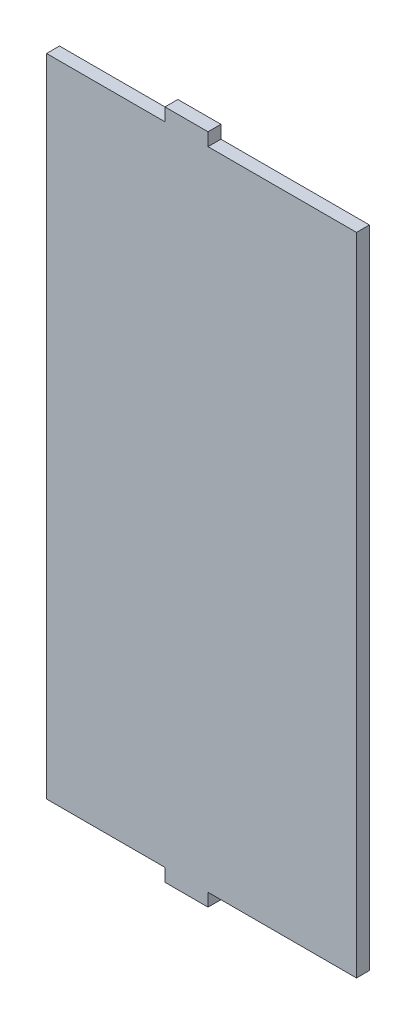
ISO-10303-21;
HEADER;
FILE_DESCRIPTION(('STEP AP214'),'2;1');
FILE_NAME('part.step','',(''),(''),'','','');
FILE_SCHEMA(('AUTOMOTIVE_DESIGN { 1 0 10303 214 1 1 1 1 }'));
ENDSEC;
DATA;
#1=APPLICATION_CONTEXT('core data for automotive mechanical design processes');
#2=APPLICATION_PROTOCOL_DEFINITION('international standard','automotive_design',2000,#1);
#3=PRODUCT_CONTEXT('',#1,'mechanical');
#4=PRODUCT('Part','Part','',(#3));
#5=PRODUCT_RELATED_PRODUCT_CATEGORY('part','',(#4));
#6=PRODUCT_DEFINITION_FORMATION('','',#4);
#7=PRODUCT_DEFINITION_CONTEXT('part definition',#1,'design');
#8=PRODUCT_DEFINITION('design','',#6,#7);
#9=PRODUCT_DEFINITION_SHAPE('','',#8);
#10=(LENGTH_UNIT() NAMED_UNIT(*) SI_UNIT(.MILLI.,.METRE.));
#11=(NAMED_UNIT(*) PLANE_ANGLE_UNIT() SI_UNIT($,.RADIAN.));
#12=(NAMED_UNIT(*) SI_UNIT($,.STERADIAN.) SOLID_ANGLE_UNIT());
#13=UNCERTAINTY_MEASURE_WITH_UNIT(LENGTH_MEASURE(1.E-05),#10,'distance_accuracy_value','');
#14=(GEOMETRIC_REPRESENTATION_CONTEXT(3) GLOBAL_UNCERTAINTY_ASSIGNED_CONTEXT((#13)) GLOBAL_UNIT_ASSIGNED_CONTEXT((#10,
#11,#12)) REPRESENTATION_CONTEXT('',''));
#15=CARTESIAN_POINT('',(0.,0.,0.));
#16=DIRECTION('',(0.,0.,1.));
#17=DIRECTION('',(1.,0.,0.));
#18=AXIS2_PLACEMENT_3D('',#15,#16,#17);
#19=CARTESIAN_POINT('',(-150.,375.,15.));
#20=DIRECTION('',(1.,0.,0.));
#21=DIRECTION('',(0.,1.,0.));
#22=AXIS2_PLACEMENT_3D('',#19,#20,#21);
#23=PLANE('',#22);
#24=DIRECTION('',(0.,-1.,0.));
#25=VECTOR('',#24,1.);
#26=CARTESIAN_POINT('',(-150.,375.,0.));
#27=LINE('',#26,#25);
#28=CARTESIAN_POINT('',(-150.,375.,0.));
#29=VERTEX_POINT('',#28);
#30=CARTESIAN_POINT('',(-150.,-375.,0.));
#31=VERTEX_POINT('',#30);
#32=EDGE_CURVE('E157',#29,#31,#27,.T.);
#33=ORIENTED_EDGE('',*,*,#32,.T.);
#34=DIRECTION('',(0.,0.,-1.));
#35=VECTOR('',#34,1.);
#36=CARTESIAN_POINT('',(-150.,-375.,15.));
#37=LINE('',#36,#35);
#38=CARTESIAN_POINT('',(-150.,-375.,15.));
#39=VERTEX_POINT('',#38);
#40=EDGE_CURVE('E11',#39,#31,#37,.T.);
#41=ORIENTED_EDGE('',*,*,#40,.F.);
#42=DIRECTION('',(0.,-1.,0.));
#43=VECTOR('',#42,1.);
#44=CARTESIAN_POINT('',(-150.,375.,15.));
#45=LINE('',#44,#43);
#46=CARTESIAN_POINT('',(-150.,375.,15.));
#47=VERTEX_POINT('',#46);
#48=EDGE_CURVE('E179',#47,#39,#45,.T.);
#49=ORIENTED_EDGE('',*,*,#48,.F.);
#50=DIRECTION('',(0.,0.,-1.));
#51=VECTOR('',#50,1.);
#52=CARTESIAN_POINT('',(-150.,375.,15.));
#53=LINE('',#52,#51);
#54=EDGE_CURVE('E153',#47,#29,#53,.T.);
#55=ORIENTED_EDGE('',*,*,#54,.T.);
#56=EDGE_LOOP('',(#33,#41,#49,#55));
#57=FACE_BOUND('',#56,.T.);
#58=ADVANCED_FACE('F37',(#57),#23,.F.);
#59=CARTESIAN_POINT('',(-150.,-375.,15.));
#60=DIRECTION('',(0.,1.,0.));
#61=DIRECTION('',(0.,0.,1.));
#62=AXIS2_PLACEMENT_3D('',#59,#60,#61);
#63=PLANE('',#62);
#64=DIRECTION('',(1.,0.,0.));
#65=VECTOR('',#64,1.);
#66=CARTESIAN_POINT('',(-150.,-375.,0.));
#67=LINE('',#66,#65);
#68=CARTESIAN_POINT('',(-12.4999999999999,-375.,0.));
#69=VERTEX_POINT('',#68);
#70=EDGE_CURVE('E160',#31,#69,#67,.T.);
#71=ORIENTED_EDGE('',*,*,#70,.T.);
#72=DIRECTION('',(0.,0.,-1.));
#73=VECTOR('',#72,1.);
#74=CARTESIAN_POINT('',(-12.4999999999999,-375.,15.));
#75=LINE('',#74,#73);
#76=CARTESIAN_POINT('',(-12.4999999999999,-375.,15.));
#77=VERTEX_POINT('',#76);
#78=EDGE_CURVE('E45',#77,#69,#75,.T.);
#79=ORIENTED_EDGE('',*,*,#78,.F.);
#80=DIRECTION('',(1.,0.,0.));
#81=VECTOR('',#80,1.);
#82=CARTESIAN_POINT('',(-150.,-375.,15.));
#83=LINE('',#82,#81);
#84=EDGE_CURVE('E108',#39,#77,#83,.T.);
#85=ORIENTED_EDGE('',*,*,#84,.F.);
#86=ORIENTED_EDGE('',*,*,#40,.T.);
#87=EDGE_LOOP('',(#71,#79,#85,#86));
#88=FACE_BOUND('',#87,.T.);
#89=ADVANCED_FACE('F257',(#88),#63,.F.);
#90=CARTESIAN_POINT('',(-12.4999999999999,-375.,15.));
#91=DIRECTION('',(1.,0.,0.));
#92=DIRECTION('',(0.,1.,0.));
#93=AXIS2_PLACEMENT_3D('',#90,#91,#92);
#94=PLANE('',#93);
#95=DIRECTION('',(0.,-1.,0.));
#96=VECTOR('',#95,1.);
#97=CARTESIAN_POINT('',(-12.4999999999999,-375.,0.));
#98=LINE('',#97,#96);
#99=CARTESIAN_POINT('',(-12.4999999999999,-390.,0.));
#100=VERTEX_POINT('',#99);
#101=EDGE_CURVE('E162',#69,#100,#98,.T.);
#102=ORIENTED_EDGE('',*,*,#101,.T.);
#103=DIRECTION('',(0.,0.,-1.));
#104=VECTOR('',#103,1.);
#105=CARTESIAN_POINT('',(-12.4999999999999,-390.,15.));
#106=LINE('',#105,#104);
#107=CARTESIAN_POINT('',(-12.4999999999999,-390.,15.));
#108=VERTEX_POINT('',#107);
#109=EDGE_CURVE('E198',#108,#100,#106,.T.);
#110=ORIENTED_EDGE('',*,*,#109,.F.);
#111=DIRECTION('',(0.,-1.,0.));
#112=VECTOR('',#111,1.);
#113=CARTESIAN_POINT('',(-12.4999999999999,-375.,15.));
#114=LINE('',#113,#112);
#115=EDGE_CURVE('E206',#77,#108,#114,.T.);
#116=ORIENTED_EDGE('',*,*,#115,.F.);
#117=ORIENTED_EDGE('',*,*,#78,.T.);
#118=EDGE_LOOP('',(#102,#110,#116,#117));
#119=FACE_BOUND('',#118,.T.);
#120=ADVANCED_FACE('F204',(#119),#94,.F.);
#121=CARTESIAN_POINT('',(-12.4999999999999,-390.,15.));
#122=DIRECTION('',(0.,1.,0.));
#123=DIRECTION('',(0.,0.,1.));
#124=AXIS2_PLACEMENT_3D('',#121,#122,#123);
#125=PLANE('',#124);
#126=DIRECTION('',(1.,0.,0.));
#127=VECTOR('',#126,1.);
#128=CARTESIAN_POINT('',(-12.4999999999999,-390.,0.));
#129=LINE('',#128,#127);
#130=CARTESIAN_POINT('',(37.5000000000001,-390.,0.));
#131=VERTEX_POINT('',#130);
#132=EDGE_CURVE('E164',#100,#131,#129,.T.);
#133=ORIENTED_EDGE('',*,*,#132,.T.);
#134=DIRECTION('',(0.,0.,-1.));
#135=VECTOR('',#134,1.);
#136=CARTESIAN_POINT('',(37.5000000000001,-390.,15.));
#137=LINE('',#136,#135);
#138=CARTESIAN_POINT('',(37.5000000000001,-390.,15.));
#139=VERTEX_POINT('',#138);
#140=EDGE_CURVE('E195',#139,#131,#137,.T.);
#141=ORIENTED_EDGE('',*,*,#140,.F.);
#142=DIRECTION('',(1.,0.,0.));
#143=VECTOR('',#142,1.);
#144=CARTESIAN_POINT('',(-12.4999999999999,-390.,15.));
#145=LINE('',#144,#143);
#146=EDGE_CURVE('E224',#108,#139,#145,.T.);
#147=ORIENTED_EDGE('',*,*,#146,.F.);
#148=ORIENTED_EDGE('',*,*,#109,.T.);
#149=EDGE_LOOP('',(#133,#141,#147,#148));
#150=FACE_BOUND('',#149,.T.);
#151=ADVANCED_FACE('F215',(#150),#125,.F.);
#152=CARTESIAN_POINT('',(37.5000000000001,-390.,15.));
#153=DIRECTION('',(-1.,0.,0.));
#154=DIRECTION('',(0.,0.,1.));
#155=AXIS2_PLACEMENT_3D('',#152,#153,#154);
#156=PLANE('',#155);
#157=DIRECTION('',(0.,1.,0.));
#158=VECTOR('',#157,1.);
#159=CARTESIAN_POINT('',(37.5000000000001,-390.,0.));
#160=LINE('',#159,#158);
#161=CARTESIAN_POINT('',(37.5000000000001,-375.,0.));
#162=VERTEX_POINT('',#161);
#163=EDGE_CURVE('E166',#131,#162,#160,.T.);
#164=ORIENTED_EDGE('',*,*,#163,.T.);
#165=DIRECTION('',(0.,0.,-1.));
#166=VECTOR('',#165,1.);
#167=CARTESIAN_POINT('',(37.5000000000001,-375.,15.));
#168=LINE('',#167,#166);
#169=CARTESIAN_POINT('',(37.5000000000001,-375.,15.));
#170=VERTEX_POINT('',#169);
#171=EDGE_CURVE('E192',#170,#162,#168,.T.);
#172=ORIENTED_EDGE('',*,*,#171,.F.);
#173=DIRECTION('',(0.,1.,0.));
#174=VECTOR('',#173,1.);
#175=CARTESIAN_POINT('',(37.5000000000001,-390.,15.));
#176=LINE('',#175,#174);
#177=EDGE_CURVE('E221',#139,#170,#176,.T.);
#178=ORIENTED_EDGE('',*,*,#177,.F.);
#179=ORIENTED_EDGE('',*,*,#140,.T.);
#180=EDGE_LOOP('',(#164,#172,#178,#179));
#181=FACE_BOUND('',#180,.T.);
#182=ADVANCED_FACE('F219',(#181),#156,.F.);
#183=CARTESIAN_POINT('',(37.5000000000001,-375.,15.));
#184=DIRECTION('',(0.,1.,0.));
#185=DIRECTION('',(0.,0.,1.));
#186=AXIS2_PLACEMENT_3D('',#183,#184,#185);
#187=PLANE('',#186);
#188=DIRECTION('',(1.,0.,0.));
#189=VECTOR('',#188,1.);
#190=CARTESIAN_POINT('',(37.5000000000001,-375.,0.));
#191=LINE('',#190,#189);
#192=CARTESIAN_POINT('',(210.,-375.,0.));
#193=VERTEX_POINT('',#192);
#194=EDGE_CURVE('E168',#162,#193,#191,.T.);
#195=ORIENTED_EDGE('',*,*,#194,.T.);
#196=DIRECTION('',(0.,0.,-1.));
#197=VECTOR('',#196,1.);
#198=CARTESIAN_POINT('',(210.,-375.,15.));
#199=LINE('',#198,#197);
#200=CARTESIAN_POINT('',(210.,-375.,15.));
#201=VERTEX_POINT('',#200);
#202=EDGE_CURVE('E189',#201,#193,#199,.T.);
#203=ORIENTED_EDGE('',*,*,#202,.F.);
#204=DIRECTION('',(1.,0.,0.));
#205=VECTOR('',#204,1.);
#206=CARTESIAN_POINT('',(37.5000000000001,-375.,15.));
#207=LINE('',#206,#205);
#208=EDGE_CURVE('E223',#170,#201,#207,.T.);
#209=ORIENTED_EDGE('',*,*,#208,.F.);
#210=ORIENTED_EDGE('',*,*,#171,.T.);
#211=EDGE_LOOP('',(#195,#203,#209,#210));
#212=FACE_BOUND('',#211,.T.);
#213=ADVANCED_FACE('F270',(#212),#187,.F.);
#214=CARTESIAN_POINT('',(210.,375.,15.));
#215=DIRECTION('',(-1.,0.,0.));
#216=DIRECTION('',(0.,-1.,0.));
#217=AXIS2_PLACEMENT_3D('',#214,#215,#216);
#218=PLANE('',#217);
#219=DIRECTION('',(0.,1.,0.));
#220=VECTOR('',#219,1.);
#221=CARTESIAN_POINT('',(210.,375.,0.));
#222=LINE('',#221,#220);
#223=CARTESIAN_POINT('',(210.,375.,0.));
#224=VERTEX_POINT('',#223);
#225=EDGE_CURVE('E170',#193,#224,#222,.T.);
#226=ORIENTED_EDGE('',*,*,#225,.T.);
#227=DIRECTION('',(0.,0.,-1.));
#228=VECTOR('',#227,1.);
#229=CARTESIAN_POINT('',(210.,375.,15.));
#230=LINE('',#229,#228);
#231=CARTESIAN_POINT('',(210.,375.,15.));
#232=VERTEX_POINT('',#231);
#233=EDGE_CURVE('E186',#232,#224,#230,.T.);
#234=ORIENTED_EDGE('',*,*,#233,.F.);
#235=DIRECTION('',(0.,1.,0.));
#236=VECTOR('',#235,1.);
#237=CARTESIAN_POINT('',(210.,375.,15.));
#238=LINE('',#237,#236);
#239=EDGE_CURVE('E226',#201,#232,#238,.T.);
#240=ORIENTED_EDGE('',*,*,#239,.F.);
#241=ORIENTED_EDGE('',*,*,#202,.T.);
#242=EDGE_LOOP('',(#226,#234,#240,#241));
#243=FACE_BOUND('',#242,.T.);
#244=ADVANCED_FACE('F273',(#243),#218,.F.);
#245=CARTESIAN_POINT('',(37.5,375.,15.));
#246=DIRECTION('',(0.,-1.,0.));
#247=DIRECTION('',(1.,0.,0.));
#248=AXIS2_PLACEMENT_3D('',#245,#246,#247);
#249=PLANE('',#248);
#250=DIRECTION('',(-1.,0.,0.));
#251=VECTOR('',#250,1.);
#252=CARTESIAN_POINT('',(37.5,375.,0.));
#253=LINE('',#252,#251);
#254=CARTESIAN_POINT('',(37.5,375.,0.));
#255=VERTEX_POINT('',#254);
#256=EDGE_CURVE('E172',#224,#255,#253,.T.);
#257=ORIENTED_EDGE('',*,*,#256,.T.);
#258=DIRECTION('',(0.,0.,-1.));
#259=VECTOR('',#258,1.);
#260=CARTESIAN_POINT('',(37.5,375.,15.));
#261=LINE('',#260,#259);
#262=CARTESIAN_POINT('',(37.5,375.,15.));
#263=VERTEX_POINT('',#262);
#264=EDGE_CURVE('E183',#263,#255,#261,.T.);
#265=ORIENTED_EDGE('',*,*,#264,.F.);
#266=DIRECTION('',(-1.,0.,0.));
#267=VECTOR('',#266,1.);
#268=CARTESIAN_POINT('',(37.5,375.,15.));
#269=LINE('',#268,#267);
#270=EDGE_CURVE('E232',#232,#263,#269,.T.);
#271=ORIENTED_EDGE('',*,*,#270,.F.);
#272=ORIENTED_EDGE('',*,*,#233,.T.);
#273=EDGE_LOOP('',(#257,#265,#271,#272));
#274=FACE_BOUND('',#273,.T.);
#275=ADVANCED_FACE('F238',(#274),#249,.F.);
#276=CARTESIAN_POINT('',(37.5,390.,15.));
#277=DIRECTION('',(-1.,0.,0.));
#278=DIRECTION('',(0.,-1.,0.));
#279=AXIS2_PLACEMENT_3D('',#276,#277,#278);
#280=PLANE('',#279);
#281=DIRECTION('',(0.,1.,0.));
#282=VECTOR('',#281,1.);
#283=CARTESIAN_POINT('',(37.5,390.,0.));
#284=LINE('',#283,#282);
#285=CARTESIAN_POINT('',(37.5,390.,0.));
#286=VERTEX_POINT('',#285);
#287=EDGE_CURVE('E174',#255,#286,#284,.T.);
#288=ORIENTED_EDGE('',*,*,#287,.T.);
#289=DIRECTION('',(0.,0.,-1.));
#290=VECTOR('',#289,1.);
#291=CARTESIAN_POINT('',(37.5,390.,15.));
#292=LINE('',#291,#290);
#293=CARTESIAN_POINT('',(37.5,390.,15.));
#294=VERTEX_POINT('',#293);
#295=EDGE_CURVE('E148',#294,#286,#292,.T.);
#296=ORIENTED_EDGE('',*,*,#295,.F.);
#297=DIRECTION('',(0.,1.,0.));
#298=VECTOR('',#297,1.);
#299=CARTESIAN_POINT('',(37.5,390.,15.));
#300=LINE('',#299,#298);
#301=EDGE_CURVE('E139',#263,#294,#300,.T.);
#302=ORIENTED_EDGE('',*,*,#301,.F.);
#303=ORIENTED_EDGE('',*,*,#264,.T.);
#304=EDGE_LOOP('',(#288,#296,#302,#303));
#305=FACE_BOUND('',#304,.T.);
#306=ADVANCED_FACE('F242',(#305),#280,.F.);
#307=CARTESIAN_POINT('',(-12.5,390.,15.));
#308=DIRECTION('',(0.,-1.,0.));
#309=DIRECTION('',(0.,0.,-1.));
#310=AXIS2_PLACEMENT_3D('',#307,#308,#309);
#311=PLANE('',#310);
#312=DIRECTION('',(-1.,0.,0.));
#313=VECTOR('',#312,1.);
#314=CARTESIAN_POINT('',(-12.5,390.,0.));
#315=LINE('',#314,#313);
#316=CARTESIAN_POINT('',(-12.5,390.,0.));
#317=VERTEX_POINT('',#316);
#318=EDGE_CURVE('E147',#286,#317,#315,.T.);
#319=ORIENTED_EDGE('',*,*,#318,.T.);
#320=DIRECTION('',(0.,0.,-1.));
#321=VECTOR('',#320,1.);
#322=CARTESIAN_POINT('',(-12.5,390.,15.));
#323=LINE('',#322,#321);
#324=CARTESIAN_POINT('',(-12.5,390.,15.));
#325=VERTEX_POINT('',#324);
#326=EDGE_CURVE('E144',#325,#317,#323,.T.);
#327=ORIENTED_EDGE('',*,*,#326,.F.);
#328=DIRECTION('',(-1.,0.,0.));
#329=VECTOR('',#328,1.);
#330=CARTESIAN_POINT('',(-12.5,390.,15.));
#331=LINE('',#330,#329);
#332=EDGE_CURVE('E133',#294,#325,#331,.T.);
#333=ORIENTED_EDGE('',*,*,#332,.F.);
#334=ORIENTED_EDGE('',*,*,#295,.T.);
#335=EDGE_LOOP('',(#319,#327,#333,#334));
#336=FACE_BOUND('',#335,.T.);
#337=ADVANCED_FACE('F145',(#336),#311,.F.);
#338=CARTESIAN_POINT('',(-12.5,375.,15.));
#339=DIRECTION('',(1.,0.,0.));
#340=DIRECTION('',(0.,0.,-1.));
#341=AXIS2_PLACEMENT_3D('',#338,#339,#340);
#342=PLANE('',#341);
#343=DIRECTION('',(0.,-1.,0.));
#344=VECTOR('',#343,1.);
#345=CARTESIAN_POINT('',(-12.5,375.,0.));
#346=LINE('',#345,#344);
#347=CARTESIAN_POINT('',(-12.5,375.,0.));
#348=VERTEX_POINT('',#347);
#349=EDGE_CURVE('E94',#317,#348,#346,.T.);
#350=ORIENTED_EDGE('',*,*,#349,.T.);
#351=DIRECTION('',(0.,0.,-1.));
#352=VECTOR('',#351,1.);
#353=CARTESIAN_POINT('',(-12.5,375.,15.));
#354=LINE('',#353,#352);
#355=CARTESIAN_POINT('',(-12.5,375.,15.));
#356=VERTEX_POINT('',#355);
#357=EDGE_CURVE('E149',#356,#348,#354,.T.);
#358=ORIENTED_EDGE('',*,*,#357,.F.);
#359=DIRECTION('',(0.,-1.,0.));
#360=VECTOR('',#359,1.);
#361=CARTESIAN_POINT('',(-12.5,375.,15.));
#362=LINE('',#361,#360);
#363=EDGE_CURVE('E137',#325,#356,#362,.T.);
#364=ORIENTED_EDGE('',*,*,#363,.F.);
#365=ORIENTED_EDGE('',*,*,#326,.T.);
#366=EDGE_LOOP('',(#350,#358,#364,#365));
#367=FACE_BOUND('',#366,.T.);
#368=ADVANCED_FACE('F151',(#367),#342,.F.);
#369=CARTESIAN_POINT('',(-150.,375.,15.));
#370=DIRECTION('',(0.,-1.,0.));
#371=DIRECTION('',(0.,0.,-1.));
#372=AXIS2_PLACEMENT_3D('',#369,#370,#371);
#373=PLANE('',#372);
#374=DIRECTION('',(-1.,0.,0.));
#375=VECTOR('',#374,1.);
#376=CARTESIAN_POINT('',(-150.,375.,0.));
#377=LINE('',#376,#375);
#378=EDGE_CURVE('E100',#348,#29,#377,.T.);
#379=ORIENTED_EDGE('',*,*,#378,.T.);
#380=ORIENTED_EDGE('',*,*,#54,.F.);
#381=DIRECTION('',(-1.,0.,0.));
#382=VECTOR('',#381,1.);
#383=CARTESIAN_POINT('',(-150.,375.,15.));
#384=LINE('',#383,#382);
#385=EDGE_CURVE('E53',#356,#47,#384,.T.);
#386=ORIENTED_EDGE('',*,*,#385,.F.);
#387=ORIENTED_EDGE('',*,*,#357,.T.);
#388=EDGE_LOOP('',(#379,#380,#386,#387));
#389=FACE_BOUND('',#388,.T.);
#390=ADVANCED_FACE('F246',(#389),#373,.F.);
#391=CARTESIAN_POINT('',(0.,0.,15.));
#392=DIRECTION('',(0.,0.,1.));
#393=DIRECTION('',(1.,0.,0.));
#394=AXIS2_PLACEMENT_3D('',#391,#392,#393);
#395=PLANE('',#394);
#396=ORIENTED_EDGE('',*,*,#48,.T.);
#397=ORIENTED_EDGE('',*,*,#84,.T.);
#398=ORIENTED_EDGE('',*,*,#115,.T.);
#399=ORIENTED_EDGE('',*,*,#146,.T.);
#400=ORIENTED_EDGE('',*,*,#177,.T.);
#401=ORIENTED_EDGE('',*,*,#208,.T.);
#402=ORIENTED_EDGE('',*,*,#239,.T.);
#403=ORIENTED_EDGE('',*,*,#270,.T.);
#404=ORIENTED_EDGE('',*,*,#301,.T.);
#405=ORIENTED_EDGE('',*,*,#332,.T.);
#406=ORIENTED_EDGE('',*,*,#363,.T.);
#407=ORIENTED_EDGE('',*,*,#385,.T.);
#408=EDGE_LOOP('',(#396,#397,#398,#399,#400,#401,#402,#403,#404,#405,#406,#407));
#409=FACE_BOUND('',#408,.T.);
#410=ADVANCED_FACE('F135',(#409),#395,.T.);
#411=CARTESIAN_POINT('',(0.,0.,0.));
#412=DIRECTION('',(0.,0.,1.));
#413=DIRECTION('',(1.,0.,0.));
#414=AXIS2_PLACEMENT_3D('',#411,#412,#413);
#415=PLANE('',#414);
#416=ORIENTED_EDGE('',*,*,#32,.F.);
#417=ORIENTED_EDGE('',*,*,#378,.F.);
#418=ORIENTED_EDGE('',*,*,#349,.F.);
#419=ORIENTED_EDGE('',*,*,#318,.F.);
#420=ORIENTED_EDGE('',*,*,#287,.F.);
#421=ORIENTED_EDGE('',*,*,#256,.F.);
#422=ORIENTED_EDGE('',*,*,#225,.F.);
#423=ORIENTED_EDGE('',*,*,#194,.F.);
#424=ORIENTED_EDGE('',*,*,#163,.F.);
#425=ORIENTED_EDGE('',*,*,#132,.F.);
#426=ORIENTED_EDGE('',*,*,#101,.F.);
#427=ORIENTED_EDGE('',*,*,#70,.F.);
#428=EDGE_LOOP('',(#416,#417,#418,#419,#420,#421,#422,#423,#424,#425,#426,#427));
#429=FACE_BOUND('',#428,.T.);
#430=ADVANCED_FACE('F210',(#429),#415,.F.);
#431=CLOSED_SHELL('',(#58,#89,#120,#151,#182,#213,#244,#275,#306,#337,#368,#390,#410,#430));
#432=MANIFOLD_SOLID_BREP('B2',#431);
#433=ADVANCED_BREP_SHAPE_REPRESENTATION('',(#18,#432),#14);
#434=SHAPE_DEFINITION_REPRESENTATION(#9,#433);
ENDSEC;
END-ISO-10303-21;
